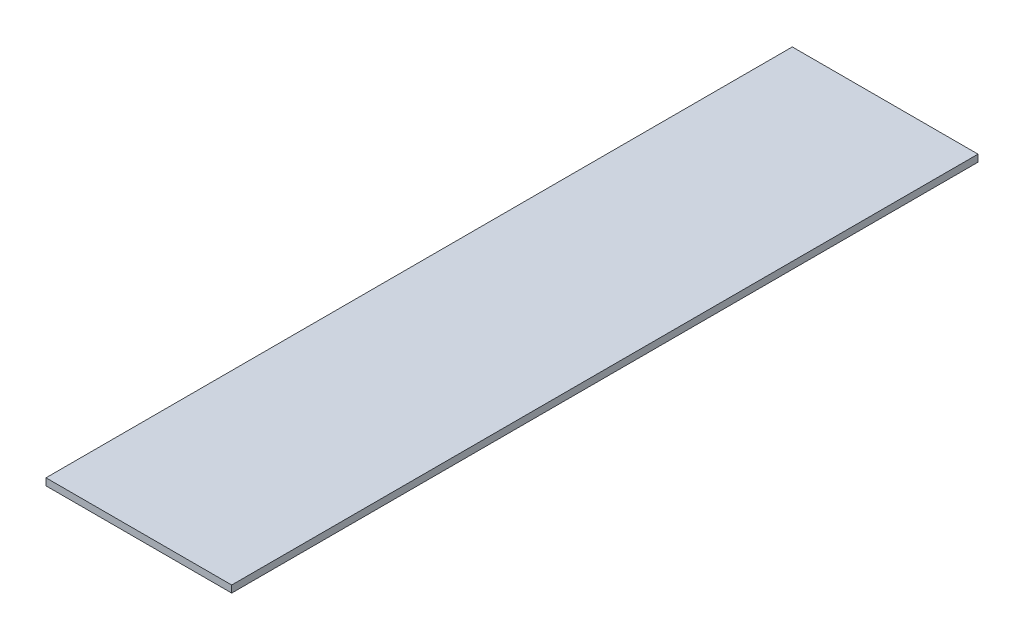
from build123d import *

# Parameters (mm, degrees)
SKETCH1_W           = 530
SKETCH1_H           = 20
BOSS_EXTRUDE1_DEPTH = 1065


with BuildPart() as part:
    # Sketch1 → Boss-Extrude1 (new, symmetric)
    with BuildSketch(Plane.XY):
        Rectangle(SKETCH1_W, SKETCH1_H)
    extrude(amount=BOSS_EXTRUDE1_DEPTH, both=True)


solid = part.part
